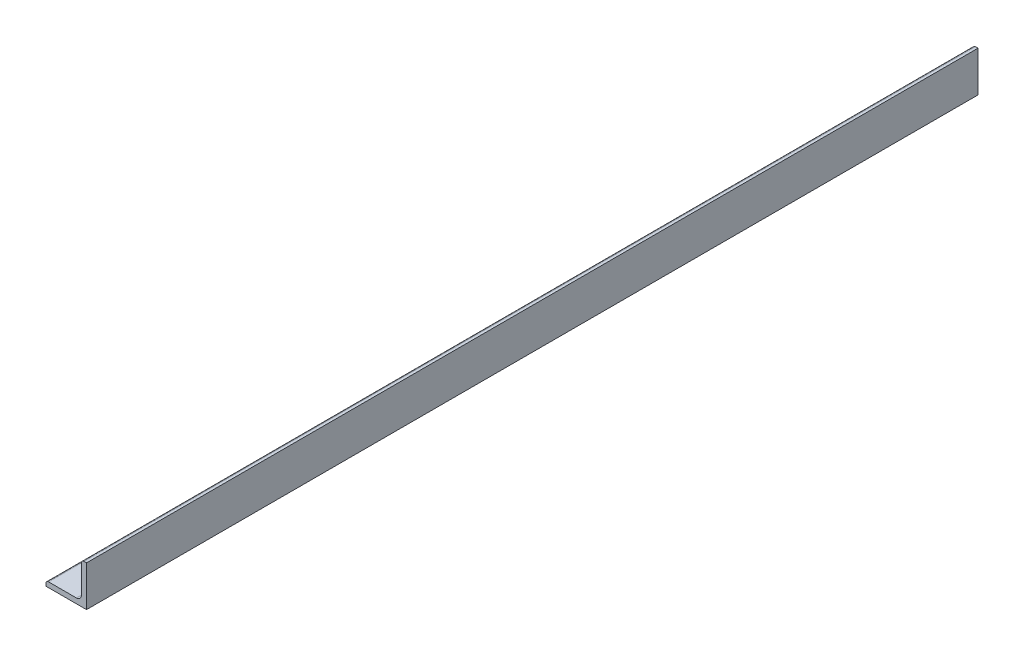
from build123d import *

# Parameters (mm, degrees)
BOSS_EXTRUDE1_DEPTH = 139.7


with BuildPart() as part:
    # Sketch2 → Boss-Extrude1 (new, symmetric)
    with BuildSketch(Plane.XY):
        with BuildLine():
            Line((-6.35, -6.35), (6.35, -6.35))
            Line((6.35, -6.35), (6.35, 6.35))
            Line((6.35, 6.35), (5.55625, 6.35))
            ThreePointArc((5.55625, 6.35), (4.994983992, 6.117516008), (4.7625, 5.55625))
            Line((4.7625, 5.55625), (4.7625, -3.1877))
            ThreePointArc((4.7625, -3.1877), (4.301251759, -4.301251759), (3.1877, -4.7625))
            Line((3.1877, -4.7625), (-5.55625, -4.7625))
            ThreePointArc((-5.55625, -4.7625), (-6.117516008, -4.994983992), (-6.35, -5.55625))
            Line((-6.35, -5.55625), (-6.35, -6.35))
        make_face()
    extrude(amount=BOSS_EXTRUDE1_DEPTH, both=True)


solid = part.part
